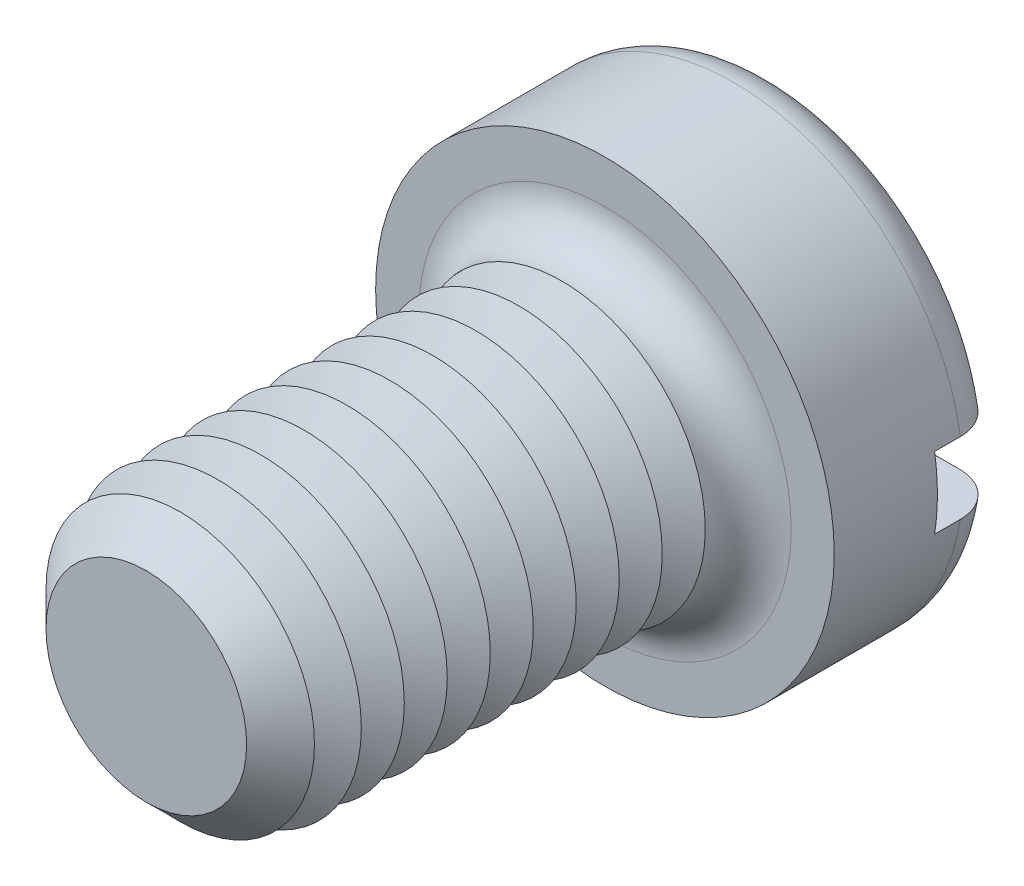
from build123d import *

# Parameters (mm, degrees)
SKETCH3_R           = 8
BOSS_EXTRUDE2_DEPTH = 6
SKETCH4_R           = 5
BOSS_EXTRUDE3_DEPTH = 16
FILLET1_R           = 1.5
CHAMFER1_SIZE       = 1.5
LPATTERN1_COUNT     = 9
LPATTERN1_PITCH     = 1.5
SKETCH8_W           = 16
SKETCH8_H           = 2.5
CUT_EXTRUDE1_DEPTH  = 2.4


with BuildPart() as part:
    # Sketch3 → Boss-Extrude2 (new body)
    with BuildSketch(Plane.XY):
        Circle(SKETCH3_R)
    extrude(amount=-BOSS_EXTRUDE2_DEPTH)

    # Sketch4 → Boss-Extrude3 (add)
    with BuildSketch(Plane.XY):
        Circle(SKETCH4_R)
    extrude(amount=BOSS_EXTRUDE3_DEPTH)

    # Fillet1
    fillet1_edges = [part.edges().sort_by_distance(p)[0] for p in [
        (-8, 0, -6),
        (-5, 0, 0),
    ]]
    fillet(fillet1_edges, radius=FILLET1_R)

    # Chamfer1
    chamfer1_edges = [part.edges().sort_by_distance(p)[0] for p in [
        (-5, 0, 16),
    ]]
    chamfer(chamfer1_edges, length=CHAMFER1_SIZE)

    # Sketch6 → Cut-Revolve1 (revolve, cut)
    with BuildSketch(Plane(origin=(0, 0, 0), x_dir=(0, 0, -1), z_dir=(1, 0, 0)), mode=Mode.PRIVATE) as cut_revolve1_sk:
        Polygon((-1.5, 5), (-2.25, 3.700961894), (-3, 5), align=None)
    cut_revolve1 = revolve(cut_revolve1_sk.sketch.rotate(Axis((0, 0, -1.694361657), (0, 0, 1)), 90), axis=Axis((0, 0, -1.694361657), (0, 0, 1)), mode=Mode.SUBTRACT)

    # LPattern1: Cut-Revolve1 ×9
    with Locations(*[(0, 0, i * LPATTERN1_PITCH) for i in range(1, LPATTERN1_COUNT)]):
        add(cut_revolve1, mode=Mode.SUBTRACT)

    # Sketch8 → Cut-Extrude1 (cut)
    with BuildSketch(Plane(origin=(0, 0, -6), x_dir=(-1, 0, 0), z_dir=(0, 0, -1))):
        Rectangle(SKETCH8_W, SKETCH8_H)
    extrude(amount=-CUT_EXTRUDE1_DEPTH, mode=Mode.SUBTRACT)


solid = part.part
